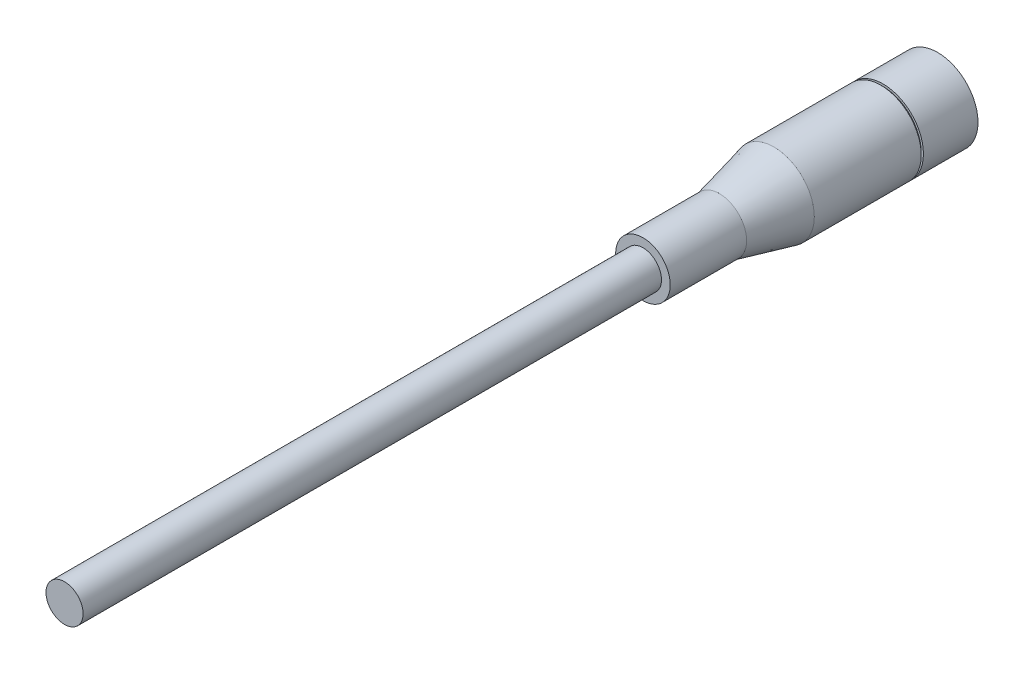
from build123d import *

# Parameters (mm, degrees)
SKETCH2_R          = 2.159
EXTRUDE1_DEPTH     = 101.6
CUT_EXTRUDE2_START = -5.08
SKETCH4_R          = 3.937
SKETCH4_R_2        = 3.175
SKETCH4_R_3        = 0.381
CUT_EXTRUDE2_DEPTH = 5.08


with BuildPart() as part:
    # S2D0001 → Revolve1 (revolve)
    with BuildSketch(Plane(origin=(0, 0, 0), x_dir=(0, 0, -1), z_dir=(1, 0, 0)), mode=Mode.PRIVATE) as revolve1_sk:
        Polygon((0, 0), (0, 4.699), (-6.35, 4.699), (-6.35, 4.445), (-6.604, 4.445), (-6.604, 4.699), (-19.05, 4.699), (-25.4, 3.175), (-34.29, 3.175), (-34.29, 0), align=None)
    revolve(revolve1_sk.sketch.rotate(Axis((0, 0, 36.0045), (0, 0, -1)), 90), axis=Axis((0, 0, 36.0045), (0, 0, -1)))

    # Sketch2 → Extrude1 (add)
    with BuildSketch(Plane(origin=(0, 0, 0), x_dir=(-1, 0, 0), z_dir=(0, 0, -1))):
        Circle(SKETCH2_R)
    extrude(amount=-EXTRUDE1_DEPTH)

    # Sketch4 → Cut-Extrude2 (cut)
    # profile 1 of 4: a face of its own
    with BuildSketch(Plane(origin=(0, 0, 0), x_dir=(-1, 0, 0), z_dir=(0, 0, -1)).offset(CUT_EXTRUDE2_START)):
        Circle(SKETCH4_R)
        with Locations(Location((0, 0, 0), (0, 0, 180))):
            Circle(SKETCH4_R_2, mode=Mode.SUBTRACT)
    # profile 2 of 4: a face of its own
    with BuildSketch(Plane(origin=(0, 0, 0), x_dir=(-1, 0, 0), z_dir=(0, 0, -1)).offset(CUT_EXTRUDE2_START)):
        with Locations((0, 2.54)):
            Circle(SKETCH4_R_3)
    # profile 3 of 4: a face of its own
    with BuildSketch(Plane(origin=(0, 0, 0), x_dir=(-1, 0, 0), z_dir=(0, 0, -1)).offset(CUT_EXTRUDE2_START)):
        with Locations((2.54, 0)):
            Circle(SKETCH4_R_3)
    # profile 4 of 4: a face of its own
    with BuildSketch(Plane(origin=(0, 0, 0), x_dir=(-1, 0, 0), z_dir=(0, 0, -1)).offset(CUT_EXTRUDE2_START)):
        with Locations((-2.54, 0)):
            Circle(SKETCH4_R_3)
    extrude(amount=CUT_EXTRUDE2_DEPTH, mode=Mode.SUBTRACT)


solid = part.part
